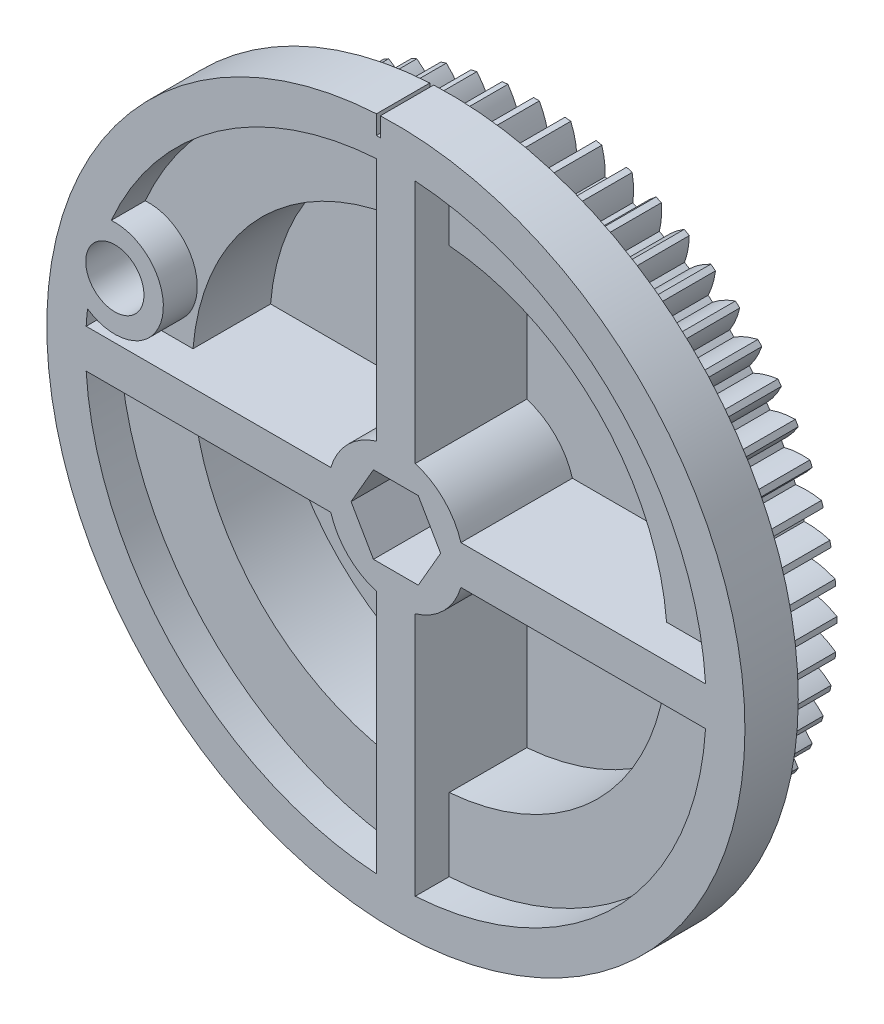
from build123d import *

# Parameters (mm, degrees)
ESQUISSE1_R                  = 15.5
BASE_EXTRUSION_DEPTH         = 4.5
ESQUISSE2_R                  = 18
BOSS_EXTRU_1_DEPTH           = 2.75
ENL_V_MAT_EXTRU_1_DEPTH      = 1.75
ENL_V_MAT_EXTRU_2_DEPTH      = 4
BOSS_EXTRU_6_START           = 1.75
BOSS_EXTRU_6_DEPTH           = 1.75
ESQUISSE7_R                  = 1.5
ENL_V_MAT_EXTRU_3_DEPTH      = 2.75
ENL_V_MAT_EXTRU_4_DEPTH      = 4.5
R_P_TITION_CIRCULAIRE1_COUNT = 60
ENL_V_MAT_EXTRU_5_DEPTH      = 27.468141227
ENL_V_MAT_EXTRU_6_REACH      = 28.468
ESQUISSE10_W                 = 0.2
ESQUISSE10_H                 = 2


with BuildPart() as part:
    # Esquisse1 → Base-Extrusion (new body)
    with BuildSketch(Plane.XY):
        Circle(ESQUISSE1_R)
    extrude(amount=BASE_EXTRUSION_DEPTH)

    # Esquisse2 → Boss.-Extru.1 (add)
    with BuildSketch(Plane.XY.offset(4.5)):
        Circle(ESQUISSE2_R)
    extrude(amount=BOSS_EXTRU_1_DEPTH)

    # Esquisse3 → Enl_v. mat.-Extru.1 (cut)
    with BuildSketch(Plane.XY.offset(7.25)):
        with BuildLine():
            Line((-1, 15.968719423), (-1, 3.354101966))
            ThreePointArc((-1, 3.354101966), (-2.474873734, 2.474873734), (-3.354101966, 1))
            Line((-3.354101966, 1), (-15.968719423, 1))
            ThreePointArc((-15.968719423, 1), (-11.313708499, 11.313708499), (-1, 15.968719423))
        make_face()
        with BuildLine():
            Line((15.968719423, 1), (3.354101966, 1))
            ThreePointArc((3.354101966, 1), (2.474873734, 2.474873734), (1, 3.354101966))
            Line((1, 3.354101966), (1, 15.968719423))
            ThreePointArc((1, 15.968719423), (11.313708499, 11.313708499), (15.968719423, 1))
        make_face()
        with BuildLine():
            Line((-15.968719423, -1), (-3.354101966, -1))
            ThreePointArc((-3.354101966, -1), (-2.474873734, -2.474873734), (-1, -3.354101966))
            Line((-1, -3.354101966), (-1, -15.968719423))
            ThreePointArc((-1, -15.968719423), (-11.313708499, -11.313708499), (-15.968719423, -1))
        make_face()
        with BuildLine():
            Line((1, -15.968719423), (1, -3.354101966))
            ThreePointArc((1, -3.354101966), (2.474873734, -2.474873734), (3.354101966, -1))
            Line((3.354101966, -1), (15.968719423, -1))
            ThreePointArc((15.968719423, -1), (11.313708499, -11.313708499), (1, -15.968719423))
        make_face()
    extrude(amount=-ENL_V_MAT_EXTRU_1_DEPTH, mode=Mode.SUBTRACT)

    # Esquisse4 → Enl_v. mat.-Extru.2 (cut)
    with BuildSketch(Plane.XY.offset(5.5)):
        with BuildLine():
            Line((-12.209115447, 1), (-3.354101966, 1))
            ThreePointArc((-3.354101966, 1), (-2.474873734, 2.474873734), (-1, 3.354101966))
            Line((-1, 3.354101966), (-1, 12.209115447))
            ThreePointArc((-1, 12.209115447), (-8.66205807, 8.66205807), (-12.209115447, 1))
        make_face()
        with BuildLine():
            Line((1, 3.354101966), (1, 12.209115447))
            ThreePointArc((1, 12.209115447), (8.66205807, 8.66205807), (12.209115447, 1))
            Line((12.209115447, 1), (3.354101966, 1))
            ThreePointArc((3.354101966, 1), (2.474873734, 2.474873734), (1, 3.354101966))
        make_face()
        with BuildLine():
            Line((12.209115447, -1), (3.354101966, -1))
            ThreePointArc((3.354101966, -1), (2.474873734, -2.474873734), (1, -3.354101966))
            Line((1, -3.354101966), (1, -12.209115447))
            ThreePointArc((1, -12.209115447), (8.66205807, -8.66205807), (12.209115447, -1))
        make_face()
        with BuildLine():
            Line((-1, -3.354101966), (-1, -12.209115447))
            ThreePointArc((-1, -12.209115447), (-8.66205807, -8.66205807), (-12.209115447, -1))
            Line((-12.209115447, -1), (-3.354101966, -1))
            ThreePointArc((-3.354101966, -1), (-2.474873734, -2.474873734), (-1, -3.354101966))
        make_face()
    extrude(amount=-ENL_V_MAT_EXTRU_2_DEPTH, mode=Mode.SUBTRACT)

    # Esquisse6 → Boss.-Extru.6 (add)
    with BuildSketch(Plane.XY.offset(5.5).offset(BOSS_EXTRU_6_START)):
        with BuildLine():
            ThreePointArc((-15.89657681, 1.816272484), (-12.074072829, 3.235238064), (-14.674975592, 6.375350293))
            ThreePointArc((-14.674975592, 6.375350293), (-15.454813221, 4.141104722), (-15.89657681, 1.816272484))
        make_face()
    extrude(amount=-BOSS_EXTRU_6_DEPTH)

    # Esquisse7 → Enl_v. mat.-Extru.3 (cut)
    with BuildSketch(Plane.XY.offset(7.25)):
        with Locations((-14.488887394, 3.882285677)):
            Circle(ESQUISSE7_R)
    extrude(amount=-ENL_V_MAT_EXTRU_3_DEPTH, mode=Mode.SUBTRACT)

    # Esquisse8 → Enl_v. mat.-Extru.4 (cut)
    with BuildSketch(Plane(origin=(0, 0, 0), x_dir=(-1, 0, 0), z_dir=(0, 0, -1))):
        with BuildLine():
            Line((0.745787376, 14.23047087), (0.86030147, 16.41552995))
            Line((0.86030147, 16.41552995), (-0.86030147, 16.41552995))
            Line((-0.86030147, 16.41552995), (-0.745787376, 14.23047087))
            ThreePointArc((-0.745787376, 14.23047087), (-0.670878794, 14.234199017), (-0.595951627, 14.23753285))
            ThreePointArc((-0.595951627, 14.23753285), (-0.42611589, 14.887185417), (-0.15, 15.499274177))
            ThreePointArc((-0.15, 15.499274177), (0, 15.5), (0.15, 15.499274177))
            ThreePointArc((0.15, 15.499274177), (0.42611589, 14.887185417), (0.595951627, 14.23753285))
            ThreePointArc((0.595951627, 14.23753285), (0.670878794, 14.234199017), (0.745787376, 14.23047087))
        make_face()
    enl_v_mat_extru_4 = extrude(amount=-ENL_V_MAT_EXTRU_4_DEPTH, mode=Mode.SUBTRACT)

    # R_p_tition circulaire1: Enl_v. mat.-Extru.4 ×60 about axis
    r_p_tition_circulaire1_axis = Axis((0, 0, 0), (0, 0, 1))
    for i in range(1, R_P_TITION_CIRCULAIRE1_COUNT):
        add(enl_v_mat_extru_4.rotate(r_p_tition_circulaire1_axis, i * 360 / R_P_TITION_CIRCULAIRE1_COUNT), mode=Mode.SUBTRACT)

    # Esquisse9 → Enl_v. mat.-Extru.5 (cut, through all)
    with BuildSketch(Plane.XY.offset(7.25)):
        Polygon((-1.154700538, 2), (1.154700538, 2), (2.309401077, 0), (1.154700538, -2), (-1.154700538, -2), (-2.309401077, 0), align=None)
    extrude(amount=-ENL_V_MAT_EXTRU_5_DEPTH, mode=Mode.SUBTRACT)

    # Esquisse10 → Enl_v. mat.-Extru.6 (cut, up to next)
    with BuildSketch(Plane.XY.offset(7.25), mode=Mode.PRIVATE) as enl_v_mat_extru_6_sk1:
        with Locations((-0.9, 18)):
            Rectangle(ESQUISSE10_W, ESQUISSE10_H)
    enl_v_mat_extru_6_tool1 = extrude(enl_v_mat_extru_6_sk1.sketch, amount=-ENL_V_MAT_EXTRU_6_REACH, mode=Mode.PRIVATE) & part.part
    add(enl_v_mat_extru_6_tool1.solids().sort_by_distance((-0.9, 18, 7.25))[0], mode=Mode.SUBTRACT)


solid = part.part
